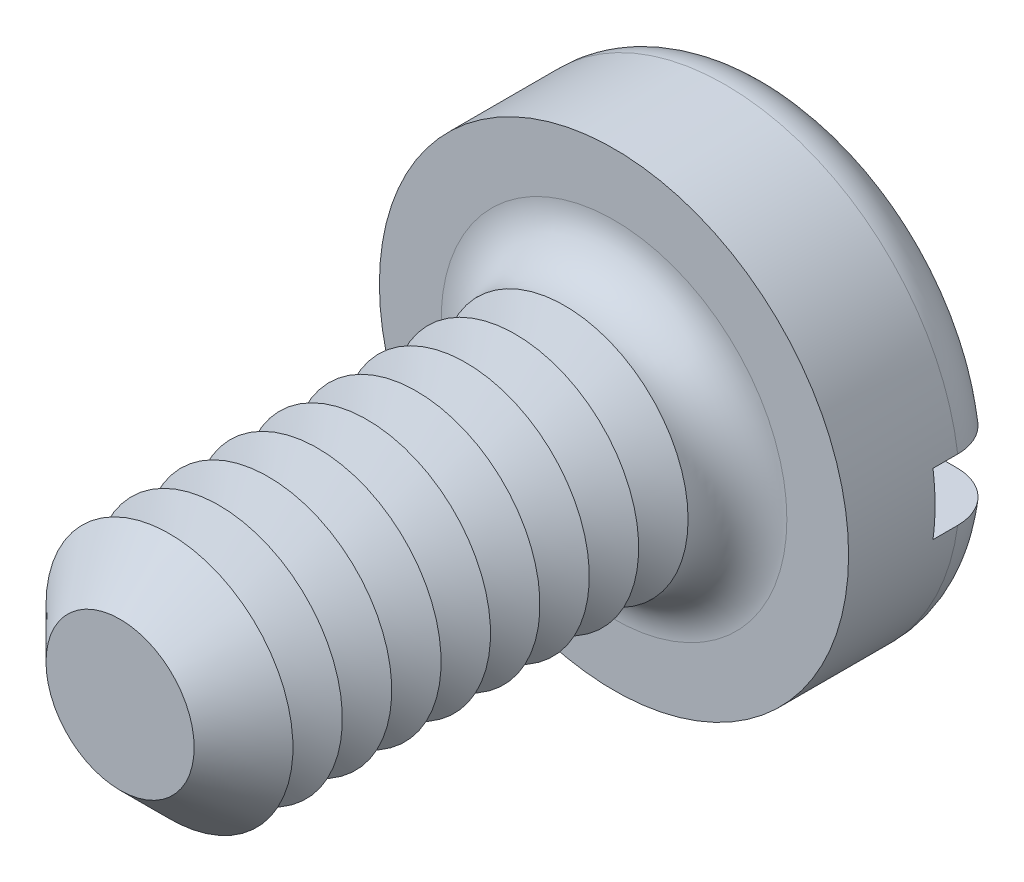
from build123d import *

# Parameters (mm, degrees)
SKETCH3_R           = 1.9
BOSS_EXTRUDE2_DEPTH = 1.3
SKETCH4_R           = 1
BOSS_EXTRUDE3_DEPTH = 4
FILLET1_R           = 0.4
CHAMFER1_SIZE       = 0.4
LPATTERN1_COUNT     = 8
LPATTERN1_PITCH     = 0.4
SKETCH8_W           = 3.8
SKETCH8_H           = 0.5
CUT_EXTRUDE1_DEPTH  = 0.6


with BuildPart() as part:
    # Sketch3 → Boss-Extrude2 (new body)
    with BuildSketch(Plane.XY):
        Circle(SKETCH3_R)
    extrude(amount=-BOSS_EXTRUDE2_DEPTH)

    # Sketch4 → Boss-Extrude3 (add)
    with BuildSketch(Plane.XY):
        Circle(SKETCH4_R)
    extrude(amount=BOSS_EXTRUDE3_DEPTH)

    # Fillet1
    fillet1_edges = [part.edges().sort_by_distance(p)[0] for p in [
        (-1.9, 0, -1.3),
        (-1, 0, 0),
    ]]
    fillet(fillet1_edges, radius=FILLET1_R)

    # Chamfer1
    chamfer1_edges = [part.edges().sort_by_distance(p)[0] for p in [
        (-1, 0, 4),
    ]]
    chamfer(chamfer1_edges, length=CHAMFER1_SIZE)

    # Sketch6 → Cut-Revolve1 (revolve, cut)
    with BuildSketch(Plane(origin=(0, 0, 0), x_dir=(0, 0, -1), z_dir=(1, 0, 0)), mode=Mode.PRIVATE) as cut_revolve1_sk:
        Polygon((-0.4, 1), (-0.6, 0.653589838), (-0.8, 1), align=None)
    cut_revolve1 = revolve(cut_revolve1_sk.sketch.rotate(Axis((0, 0, -1.694361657), (0, 0, 1)), 90), axis=Axis((0, 0, -1.694361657), (0, 0, 1)), mode=Mode.SUBTRACT)

    # LPattern1: Cut-Revolve1 ×8
    with Locations(*[(0, 0, i * LPATTERN1_PITCH) for i in range(1, LPATTERN1_COUNT)]):
        add(cut_revolve1, mode=Mode.SUBTRACT)

    # Sketch8 → Cut-Extrude1 (cut)
    with BuildSketch(Plane(origin=(0, 0, -1.3), x_dir=(-1, 0, 0), z_dir=(0, 0, -1))):
        Rectangle(SKETCH8_W, SKETCH8_H)
    extrude(amount=-CUT_EXTRUDE1_DEPTH, mode=Mode.SUBTRACT)


solid = part.part
